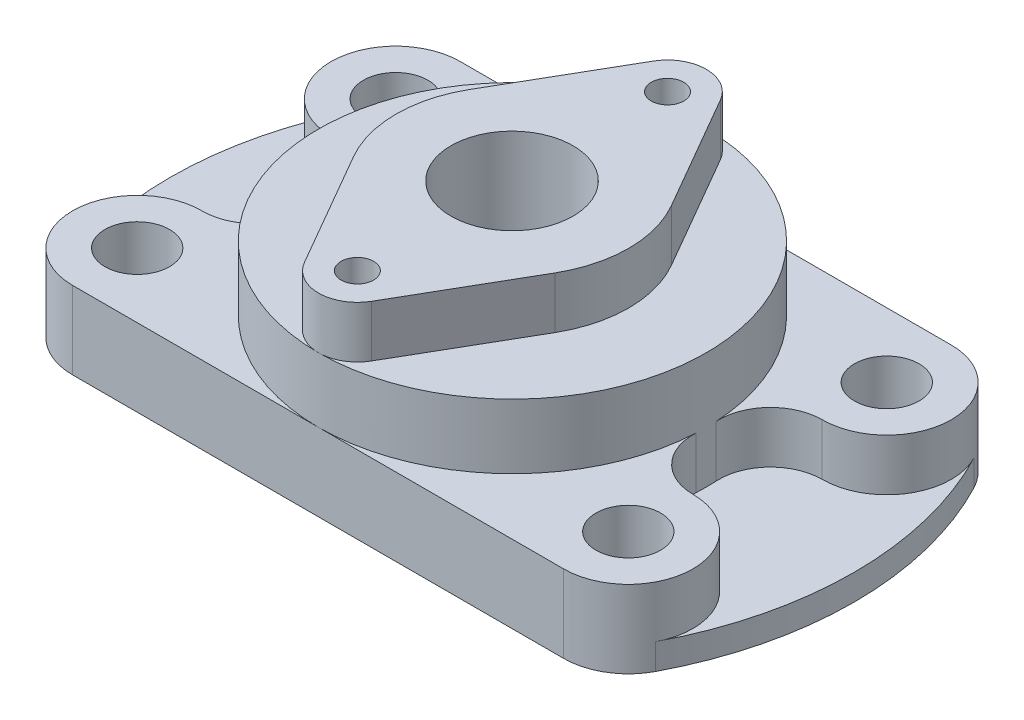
ISO-10303-21;
HEADER;
FILE_DESCRIPTION(('STEP AP214'),'2;1');
FILE_NAME('part.step','',(''),(''),'','','');
FILE_SCHEMA(('AUTOMOTIVE_DESIGN { 1 0 10303 214 1 1 1 1 }'));
ENDSEC;
DATA;
#1=APPLICATION_CONTEXT('core data for automotive mechanical design processes');
#2=APPLICATION_PROTOCOL_DEFINITION('international standard','automotive_design',2000,#1);
#3=PRODUCT_CONTEXT('',#1,'mechanical');
#4=PRODUCT('Part','Part','',(#3));
#5=PRODUCT_RELATED_PRODUCT_CATEGORY('part','',(#4));
#6=PRODUCT_DEFINITION_FORMATION('','',#4);
#7=PRODUCT_DEFINITION_CONTEXT('part definition',#1,'design');
#8=PRODUCT_DEFINITION('design','',#6,#7);
#9=PRODUCT_DEFINITION_SHAPE('','',#8);
#10=(LENGTH_UNIT() NAMED_UNIT(*) SI_UNIT(.MILLI.,.METRE.));
#11=(NAMED_UNIT(*) PLANE_ANGLE_UNIT() SI_UNIT($,.RADIAN.));
#12=(NAMED_UNIT(*) SI_UNIT($,.STERADIAN.) SOLID_ANGLE_UNIT());
#13=UNCERTAINTY_MEASURE_WITH_UNIT(LENGTH_MEASURE(1.E-05),#10,'distance_accuracy_value','');
#14=(GEOMETRIC_REPRESENTATION_CONTEXT(3) GLOBAL_UNCERTAINTY_ASSIGNED_CONTEXT((#13)) GLOBAL_UNIT_ASSIGNED_CONTEXT((#10,
#11,#12)) REPRESENTATION_CONTEXT('',''));
#15=CARTESIAN_POINT('',(0.,0.,0.));
#16=DIRECTION('',(0.,0.,1.));
#17=DIRECTION('',(1.,0.,0.));
#18=AXIS2_PLACEMENT_3D('',#15,#16,#17);
#19=CARTESIAN_POINT('',(0.0521752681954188,0.,0.));
#20=DIRECTION('',(0.,-1.,0.));
#21=DIRECTION('',(0.,0.,-1.));
#22=AXIS2_PLACEMENT_3D('',#19,#20,#21);
#23=PLANE('',#22);
#24=CARTESIAN_POINT('',(0.,0.,0.));
#25=DIRECTION('',(0.,1.,0.));
#26=DIRECTION('',(0.,0.,1.));
#27=AXIS2_PLACEMENT_3D('',#24,#25,#26);
#28=CIRCLE('',#27,7.49999999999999);
#29=CARTESIAN_POINT('',(0.,0.,7.49999999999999));
#30=VERTEX_POINT('',#29);
#31=EDGE_CURVE('E239',#30,#30,#28,.T.);
#32=ORIENTED_EDGE('',*,*,#31,.T.);
#33=EDGE_LOOP('',(#32));
#34=FACE_BOUND('',#33,.T.);
#35=CARTESIAN_POINT('',(30.1625,0.,15.875));
#36=DIRECTION('',(0.,-1.,0.));
#37=DIRECTION('',(0.,0.,1.));
#38=AXIS2_PLACEMENT_3D('',#35,#36,#37);
#39=CIRCLE('',#38,3.96875);
#40=CARTESIAN_POINT('',(30.1625,0.,19.84375));
#41=VERTEX_POINT('',#40);
#42=EDGE_CURVE('E242',#41,#41,#39,.T.);
#43=ORIENTED_EDGE('',*,*,#42,.F.);
#44=EDGE_LOOP('',(#43));
#45=FACE_BOUND('',#44,.T.);
#46=CARTESIAN_POINT('',(-30.1625,0.,15.875));
#47=DIRECTION('',(0.,1.,0.));
#48=DIRECTION('',(0.,0.,1.));
#49=AXIS2_PLACEMENT_3D('',#46,#47,#48);
#50=CIRCLE('',#49,3.96875);
#51=CARTESIAN_POINT('',(-30.1625,0.,19.84375));
#52=VERTEX_POINT('',#51);
#53=EDGE_CURVE('E253',#52,#52,#50,.T.);
#54=ORIENTED_EDGE('',*,*,#53,.T.);
#55=EDGE_LOOP('',(#54));
#56=FACE_BOUND('',#55,.T.);
#57=CARTESIAN_POINT('',(30.1625,0.,15.875));
#58=DIRECTION('',(0.,1.,0.));
#59=DIRECTION('',(0.,0.,-1.));
#60=AXIS2_PLACEMENT_3D('',#57,#58,#59);
#61=CIRCLE('',#60,7.9375);
#62=CARTESIAN_POINT('',(30.1625,0.,23.8125));
#63=VERTEX_POINT('',#62);
#64=CARTESIAN_POINT('',(37.1891686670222,0.,19.5668604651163));
#65=VERTEX_POINT('',#64);
#66=EDGE_CURVE('E398',#63,#65,#61,.T.);
#67=ORIENTED_EDGE('',*,*,#66,.F.);
#68=DIRECTION('',(1.,0.,0.));
#69=VECTOR('',#68,1.);
#70=CARTESIAN_POINT('',(-30.1625,0.,23.8125));
#71=LINE('',#70,#69);
#72=CARTESIAN_POINT('',(-30.1625,0.,23.8125));
#73=VERTEX_POINT('',#72);
#74=EDGE_CURVE('E396',#73,#63,#71,.T.);
#75=ORIENTED_EDGE('',*,*,#74,.F.);
#76=CARTESIAN_POINT('',(-30.1625,0.,15.875));
#77=DIRECTION('',(0.,1.,0.));
#78=DIRECTION('',(0.,0.,-1.));
#79=AXIS2_PLACEMENT_3D('',#76,#77,#78);
#80=CIRCLE('',#79,7.9375);
#81=CARTESIAN_POINT('',(-37.1891686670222,0.,19.5668604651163));
#82=VERTEX_POINT('',#81);
#83=EDGE_CURVE('E394',#82,#73,#80,.T.);
#84=ORIENTED_EDGE('',*,*,#83,.F.);
#85=CARTESIAN_POINT('',(0.0521752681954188,0.,0.));
#86=DIRECTION('',(0.,1.,0.));
#87=DIRECTION('',(0.,0.,-1.));
#88=AXIS2_PLACEMENT_3D('',#85,#86,#87);
#89=CIRCLE('',#88,42.06875);
#90=CARTESIAN_POINT('',(-37.1891686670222,0.,-19.5668604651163));
#91=VERTEX_POINT('',#90);
#92=EDGE_CURVE('E385',#91,#82,#89,.T.);
#93=ORIENTED_EDGE('',*,*,#92,.F.);
#94=CARTESIAN_POINT('',(-30.1625,0.,-15.875));
#95=DIRECTION('',(0.,1.,0.));
#96=DIRECTION('',(0.,0.,-1.));
#97=AXIS2_PLACEMENT_3D('',#94,#95,#96);
#98=CIRCLE('',#97,7.9375);
#99=CARTESIAN_POINT('',(-30.1625,0.,-23.8125));
#100=VERTEX_POINT('',#99);
#101=EDGE_CURVE('E389',#100,#91,#98,.T.);
#102=ORIENTED_EDGE('',*,*,#101,.F.);
#103=DIRECTION('',(-1.,0.,0.));
#104=VECTOR('',#103,1.);
#105=CARTESIAN_POINT('',(-30.1625,0.,-23.8125));
#106=LINE('',#105,#104);
#107=CARTESIAN_POINT('',(30.1625,0.,-23.8125));
#108=VERTEX_POINT('',#107);
#109=EDGE_CURVE('E404',#108,#100,#106,.T.);
#110=ORIENTED_EDGE('',*,*,#109,.F.);
#111=CARTESIAN_POINT('',(30.1625,0.,-15.875));
#112=DIRECTION('',(0.,1.,0.));
#113=DIRECTION('',(0.,0.,1.));
#114=AXIS2_PLACEMENT_3D('',#111,#112,#113);
#115=CIRCLE('',#114,7.9375);
#116=CARTESIAN_POINT('',(37.1891686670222,0.,-19.5668604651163));
#117=VERTEX_POINT('',#116);
#118=EDGE_CURVE('E402',#117,#108,#115,.T.);
#119=ORIENTED_EDGE('',*,*,#118,.F.);
#120=CARTESIAN_POINT('',(-0.0521752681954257,0.,0.));
#121=DIRECTION('',(0.,1.,0.));
#122=DIRECTION('',(0.,0.,-1.));
#123=AXIS2_PLACEMENT_3D('',#120,#121,#122);
#124=CIRCLE('',#123,42.06875);
#125=EDGE_CURVE('E400',#65,#117,#124,.T.);
#126=ORIENTED_EDGE('',*,*,#125,.F.);
#127=EDGE_LOOP('',(#67,#75,#84,#93,#102,#110,#119,#126));
#128=FACE_BOUND('',#127,.T.);
#129=CARTESIAN_POINT('',(-30.1625,0.,-15.875));
#130=DIRECTION('',(0.,-1.,0.));
#131=DIRECTION('',(0.,0.,-1.));
#132=AXIS2_PLACEMENT_3D('',#129,#130,#131);
#133=CIRCLE('',#132,3.96875);
#134=CARTESIAN_POINT('',(-30.1625,0.,-19.84375));
#135=VERTEX_POINT('',#134);
#136=EDGE_CURVE('E249',#135,#135,#133,.T.);
#137=ORIENTED_EDGE('',*,*,#136,.F.);
#138=EDGE_LOOP('',(#137));
#139=FACE_BOUND('',#138,.T.);
#140=CARTESIAN_POINT('',(30.1625,0.,-15.875));
#141=DIRECTION('',(0.,1.,0.));
#142=DIRECTION('',(0.,0.,-1.));
#143=AXIS2_PLACEMENT_3D('',#140,#141,#142);
#144=CIRCLE('',#143,3.96875);
#145=CARTESIAN_POINT('',(30.1625,0.,-19.84375));
#146=VERTEX_POINT('',#145);
#147=EDGE_CURVE('E245',#146,#146,#144,.T.);
#148=ORIENTED_EDGE('',*,*,#147,.T.);
#149=EDGE_LOOP('',(#148));
#150=FACE_BOUND('',#149,.T.);
#151=ADVANCED_FACE('F34',(#34,#45,#56,#128,#139,#150),#23,.T.);
#152=CARTESIAN_POINT('',(-30.1625,9.525,-15.875));
#153=DIRECTION('',(0.,1.,0.));
#154=DIRECTION('',(0.,0.,1.));
#155=AXIS2_PLACEMENT_3D('',#152,#153,#154);
#156=PLANE('',#155);
#157=DIRECTION('',(-1.,0.,0.));
#158=VECTOR('',#157,1.);
#159=CARTESIAN_POINT('',(-30.1625,9.525,-23.8125));
#160=LINE('',#159,#158);
#161=CARTESIAN_POINT('',(30.1625,9.525,-23.8125));
#162=VERTEX_POINT('',#161);
#163=CARTESIAN_POINT('',(0.0521752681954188,9.525,-23.8125));
#164=VERTEX_POINT('',#163);
#165=EDGE_CURVE('E328',#162,#164,#160,.T.);
#166=ORIENTED_EDGE('',*,*,#165,.T.);
#167=CARTESIAN_POINT('',(0.0521752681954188,9.525,0.));
#168=DIRECTION('',(0.,1.,0.));
#169=DIRECTION('',(0.,0.,1.));
#170=AXIS2_PLACEMENT_3D('',#167,#168,#169);
#171=CIRCLE('',#170,23.8125);
#172=CARTESIAN_POINT('',(23.8316709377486,9.525,-1.2532924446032));
#173=VERTEX_POINT('',#172);
#174=EDGE_CURVE('E562',#164,#173,#171,.F.);
#175=ORIENTED_EDGE('',*,*,#174,.T.);
#176=CARTESIAN_POINT('',(30.1728697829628,9.525,-1.58750376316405));
#177=DIRECTION('',(0.,-1.,0.));
#178=DIRECTION('',(0.,0.,1.));
#179=AXIS2_PLACEMENT_3D('',#176,#177,#178);
#180=CIRCLE('',#179,6.35);
#181=CARTESIAN_POINT('',(30.1682609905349,9.525,-7.93750209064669));
#182=VERTEX_POINT('',#181);
#183=EDGE_CURVE('E322',#173,#182,#180,.T.);
#184=ORIENTED_EDGE('',*,*,#183,.T.);
#185=CARTESIAN_POINT('',(30.1625,9.525,-15.875));
#186=DIRECTION('',(0.,1.,0.));
#187=DIRECTION('',(0.,0.,1.));
#188=AXIS2_PLACEMENT_3D('',#185,#186,#187);
#189=CIRCLE('',#188,7.9375);
#190=EDGE_CURVE('E324',#182,#162,#189,.T.);
#191=ORIENTED_EDGE('',*,*,#190,.T.);
#192=EDGE_LOOP('',(#166,#175,#184,#191));
#193=FACE_BOUND('',#192,.T.);
#194=CARTESIAN_POINT('',(30.1625,9.525,-15.875));
#195=DIRECTION('',(0.,1.,0.));
#196=DIRECTION('',(0.,0.,1.));
#197=AXIS2_PLACEMENT_3D('',#194,#195,#196);
#198=CIRCLE('',#197,3.96875);
#199=CARTESIAN_POINT('',(30.1625,9.525,-11.90625));
#200=VERTEX_POINT('',#199);
#201=EDGE_CURVE('E248',#200,#200,#198,.F.);
#202=ORIENTED_EDGE('',*,*,#201,.T.);
#203=EDGE_LOOP('',(#202));
#204=FACE_BOUND('',#203,.T.);
#205=ADVANCED_FACE('F459',(#193,#204),#156,.T.);
#206=DIRECTION('',(1.,0.,0.));
#207=VECTOR('',#206,1.);
#208=CARTESIAN_POINT('',(-30.1625,9.525,23.8125));
#209=LINE('',#208,#207);
#210=CARTESIAN_POINT('',(-30.1625,9.525,23.8125));
#211=VERTEX_POINT('',#210);
#212=CARTESIAN_POINT('',(0.0521752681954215,9.525,23.8125));
#213=VERTEX_POINT('',#212);
#214=EDGE_CURVE('E314',#211,#213,#209,.T.);
#215=ORIENTED_EDGE('',*,*,#214,.T.);
#216=CARTESIAN_POINT('',(-23.7273076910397,9.525,1.25353358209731));
#217=VERTEX_POINT('',#216);
#218=EDGE_CURVE('E60',#213,#217,#171,.F.);
#219=ORIENTED_EDGE('',*,*,#218,.T.);
#220=CARTESIAN_POINT('',(-30.0685031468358,9.525,1.58780920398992));
#221=DIRECTION('',(0.,-1.,0.));
#222=DIRECTION('',(0.,0.,1.));
#223=AXIS2_PLACEMENT_3D('',#220,#221,#222);
#224=CIRCLE('',#223,6.35);
#225=CARTESIAN_POINT('',(-30.1102795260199,9.525,7.9376717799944));
#226=VERTEX_POINT('',#225);
#227=EDGE_CURVE('E308',#217,#226,#224,.T.);
#228=ORIENTED_EDGE('',*,*,#227,.T.);
#229=CARTESIAN_POINT('',(-30.1625,9.525,15.875));
#230=DIRECTION('',(0.,1.,0.));
#231=DIRECTION('',(0.,0.,1.));
#232=AXIS2_PLACEMENT_3D('',#229,#230,#231);
#233=CIRCLE('',#232,7.9375);
#234=EDGE_CURVE('E310',#226,#211,#233,.T.);
#235=ORIENTED_EDGE('',*,*,#234,.T.);
#236=EDGE_LOOP('',(#215,#219,#228,#235));
#237=FACE_BOUND('',#236,.T.);
#238=CARTESIAN_POINT('',(-30.1625,9.525,15.875));
#239=DIRECTION('',(0.,1.,0.));
#240=DIRECTION('',(0.,0.,1.));
#241=AXIS2_PLACEMENT_3D('',#238,#239,#240);
#242=CIRCLE('',#241,3.96875);
#243=CARTESIAN_POINT('',(-30.1625,9.525,19.84375));
#244=VERTEX_POINT('',#243);
#245=EDGE_CURVE('E256',#244,#244,#242,.F.);
#246=ORIENTED_EDGE('',*,*,#245,.T.);
#247=EDGE_LOOP('',(#246));
#248=FACE_BOUND('',#247,.T.);
#249=ADVANCED_FACE('F475',(#237,#248),#156,.T.);
#250=CARTESIAN_POINT('',(0.0521752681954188,17.4625,0.));
#251=DIRECTION('',(0.,1.,0.));
#252=DIRECTION('',(0.,0.,1.));
#253=AXIS2_PLACEMENT_3D('',#250,#251,#252);
#254=PLANE('',#253);
#255=CARTESIAN_POINT('',(0.0521752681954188,17.4625,0.));
#256=DIRECTION('',(0.,1.,0.));
#257=DIRECTION('',(0.,0.,1.));
#258=AXIS2_PLACEMENT_3D('',#255,#256,#257);
#259=CIRCLE('',#258,23.8125);
#260=CARTESIAN_POINT('',(0.0521752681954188,17.4625,-23.8125));
#261=VERTEX_POINT('',#260);
#262=CARTESIAN_POINT('',(0.0521752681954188,17.4625,23.8125));
#263=VERTEX_POINT('',#262);
#264=EDGE_CURVE('E298',#261,#263,#259,.T.);
#265=ORIENTED_EDGE('',*,*,#264,.T.);
#266=CARTESIAN_POINT('',(0.0521752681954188,17.4625,19.05));
#267=DIRECTION('',(0.,1.,0.));
#268=DIRECTION('',(0.,0.,1.));
#269=AXIS2_PLACEMENT_3D('',#266,#267,#268);
#270=CIRCLE('',#269,4.7625);
#271=CARTESIAN_POINT('',(-4.07227071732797,17.4625,21.43125));
#272=VERTEX_POINT('',#271);
#273=EDGE_CURVE('E11',#263,#272,#270,.F.);
#274=ORIENTED_EDGE('',*,*,#273,.T.);
#275=DIRECTION('',(-0.5,0.,-0.866025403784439));
#276=VECTOR('',#275,1.);
#277=CARTESIAN_POINT('',(-12.3211626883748,17.4625,7.14375000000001));
#278=LINE('',#277,#276);
#279=CARTESIAN_POINT('',(-12.3211626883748,17.4625,7.14375000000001));
#280=VERTEX_POINT('',#279);
#281=EDGE_CURVE('E43',#272,#280,#278,.T.);
#282=ORIENTED_EDGE('',*,*,#281,.T.);
#283=CARTESIAN_POINT('',(0.0521752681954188,17.4625,0.));
#284=DIRECTION('',(0.,1.,0.));
#285=DIRECTION('',(0.,0.,1.));
#286=AXIS2_PLACEMENT_3D('',#283,#284,#285);
#287=CIRCLE('',#286,14.2875);
#288=CARTESIAN_POINT('',(-12.3211626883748,17.4625,-7.14374999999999));
#289=VERTEX_POINT('',#288);
#290=EDGE_CURVE('E439',#280,#289,#287,.F.);
#291=ORIENTED_EDGE('',*,*,#290,.T.);
#292=DIRECTION('',(0.5,0.,-0.866025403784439));
#293=VECTOR('',#292,1.);
#294=CARTESIAN_POINT('',(-12.3211626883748,17.4625,-7.14374999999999));
#295=LINE('',#294,#293);
#296=CARTESIAN_POINT('',(-4.07227071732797,17.4625,-21.43125));
#297=VERTEX_POINT('',#296);
#298=EDGE_CURVE('E433',#289,#297,#295,.T.);
#299=ORIENTED_EDGE('',*,*,#298,.T.);
#300=CARTESIAN_POINT('',(0.0521752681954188,17.4625,-19.05));
#301=DIRECTION('',(0.,1.,0.));
#302=DIRECTION('',(0.,0.,1.));
#303=AXIS2_PLACEMENT_3D('',#300,#301,#302);
#304=CIRCLE('',#303,4.7625);
#305=EDGE_CURVE('E436',#297,#261,#304,.F.);
#306=ORIENTED_EDGE('',*,*,#305,.T.);
#307=EDGE_LOOP('',(#265,#274,#282,#291,#299,#306));
#308=FACE_BOUND('',#307,.T.);
#309=ADVANCED_FACE('F614',(#308),#254,.T.);
#310=DIRECTION('',(-0.5,0.,0.866025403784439));
#311=VECTOR('',#310,1.);
#312=CARTESIAN_POINT('',(12.4255132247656,17.4625,7.14375));
#313=LINE('',#312,#311);
#314=CARTESIAN_POINT('',(12.4255132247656,17.4625,7.14375));
#315=VERTEX_POINT('',#314);
#316=CARTESIAN_POINT('',(4.17662125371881,17.4625,21.43125));
#317=VERTEX_POINT('',#316);
#318=EDGE_CURVE('E449',#315,#317,#313,.T.);
#319=ORIENTED_EDGE('',*,*,#318,.T.);
#320=EDGE_CURVE('E45',#317,#263,#270,.F.);
#321=ORIENTED_EDGE('',*,*,#320,.T.);
#322=EDGE_CURVE('E299',#263,#261,#259,.T.);
#323=ORIENTED_EDGE('',*,*,#322,.T.);
#324=CARTESIAN_POINT('',(4.17662125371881,17.4625,-21.43125));
#325=VERTEX_POINT('',#324);
#326=EDGE_CURVE('E440',#261,#325,#304,.F.);
#327=ORIENTED_EDGE('',*,*,#326,.T.);
#328=DIRECTION('',(0.5,0.,0.866025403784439));
#329=VECTOR('',#328,1.);
#330=CARTESIAN_POINT('',(12.4255132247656,17.4625,-7.14374999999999));
#331=LINE('',#330,#329);
#332=CARTESIAN_POINT('',(12.4255132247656,17.4625,-7.14374999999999));
#333=VERTEX_POINT('',#332);
#334=EDGE_CURVE('E443',#325,#333,#331,.T.);
#335=ORIENTED_EDGE('',*,*,#334,.T.);
#336=CARTESIAN_POINT('',(0.0521752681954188,17.4625,0.));
#337=DIRECTION('',(0.,1.,0.));
#338=DIRECTION('',(0.,0.,1.));
#339=AXIS2_PLACEMENT_3D('',#336,#337,#338);
#340=CIRCLE('',#339,14.2875);
#341=EDGE_CURVE('E446',#333,#315,#340,.F.);
#342=ORIENTED_EDGE('',*,*,#341,.T.);
#343=EDGE_LOOP('',(#319,#321,#323,#327,#335,#342));
#344=FACE_BOUND('',#343,.T.);
#345=ADVANCED_FACE('F619',(#344),#254,.T.);
#346=CARTESIAN_POINT('',(-30.1625,9.525,-15.875));
#347=DIRECTION('',(0.,1.,0.));
#348=DIRECTION('',(0.,0.,1.));
#349=AXIS2_PLACEMENT_3D('',#346,#347,#348);
#350=CIRCLE('',#349,3.96875);
#351=CARTESIAN_POINT('',(-30.1625,9.525,-11.90625));
#352=VERTEX_POINT('',#351);
#353=EDGE_CURVE('E252',#352,#352,#350,.T.);
#354=ORIENTED_EDGE('',*,*,#353,.F.);
#355=EDGE_LOOP('',(#354));
#356=FACE_BOUND('',#355,.T.);
#357=CARTESIAN_POINT('',(-30.0685031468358,9.525,-1.58780920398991));
#358=DIRECTION('',(0.,-1.,0.));
#359=DIRECTION('',(0.,0.,-1.));
#360=AXIS2_PLACEMENT_3D('',#357,#358,#359);
#361=CIRCLE('',#360,6.35);
#362=CARTESIAN_POINT('',(-30.1102795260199,9.525,-7.93767177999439));
#363=VERTEX_POINT('',#362);
#364=CARTESIAN_POINT('',(-23.7273076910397,9.525,-1.2535335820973));
#365=VERTEX_POINT('',#364);
#366=EDGE_CURVE('E305',#363,#365,#361,.T.);
#367=ORIENTED_EDGE('',*,*,#366,.T.);
#368=EDGE_CURVE('E432',#365,#164,#171,.F.);
#369=ORIENTED_EDGE('',*,*,#368,.T.);
#370=CARTESIAN_POINT('',(-30.1625,9.525,-23.8125));
#371=VERTEX_POINT('',#370);
#372=EDGE_CURVE('E327',#164,#371,#160,.T.);
#373=ORIENTED_EDGE('',*,*,#372,.T.);
#374=CARTESIAN_POINT('',(-30.1625,9.525,-15.875));
#375=DIRECTION('',(0.,1.,0.));
#376=DIRECTION('',(0.,0.,1.));
#377=AXIS2_PLACEMENT_3D('',#374,#375,#376);
#378=CIRCLE('',#377,7.9375);
#379=EDGE_CURVE('E302',#371,#363,#378,.T.);
#380=ORIENTED_EDGE('',*,*,#379,.T.);
#381=EDGE_LOOP('',(#367,#369,#373,#380));
#382=FACE_BOUND('',#381,.T.);
#383=ADVANCED_FACE('F478',(#356,#382),#156,.T.);
#384=CARTESIAN_POINT('',(30.1625,9.525,15.875));
#385=DIRECTION('',(0.,1.,0.));
#386=DIRECTION('',(0.,0.,1.));
#387=AXIS2_PLACEMENT_3D('',#384,#385,#386);
#388=CIRCLE('',#387,3.96875);
#389=CARTESIAN_POINT('',(30.1625,9.525,19.84375));
#390=VERTEX_POINT('',#389);
#391=EDGE_CURVE('E38',#390,#390,#388,.T.);
#392=ORIENTED_EDGE('',*,*,#391,.F.);
#393=EDGE_LOOP('',(#392));
#394=FACE_BOUND('',#393,.T.);
#395=CARTESIAN_POINT('',(30.1728697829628,9.525,1.58750376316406));
#396=DIRECTION('',(0.,-1.,0.));
#397=DIRECTION('',(0.,0.,-1.));
#398=AXIS2_PLACEMENT_3D('',#395,#396,#397);
#399=CIRCLE('',#398,6.35);
#400=CARTESIAN_POINT('',(30.1682609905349,9.525,7.9375020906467));
#401=VERTEX_POINT('',#400);
#402=CARTESIAN_POINT('',(23.8316709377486,9.525,1.25329244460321));
#403=VERTEX_POINT('',#402);
#404=EDGE_CURVE('E319',#401,#403,#399,.T.);
#405=ORIENTED_EDGE('',*,*,#404,.T.);
#406=EDGE_CURVE('E430',#403,#213,#171,.F.);
#407=ORIENTED_EDGE('',*,*,#406,.T.);
#408=CARTESIAN_POINT('',(30.1625,9.525,23.8125));
#409=VERTEX_POINT('',#408);
#410=EDGE_CURVE('E313',#213,#409,#209,.T.);
#411=ORIENTED_EDGE('',*,*,#410,.T.);
#412=CARTESIAN_POINT('',(30.1625,9.525,15.875));
#413=DIRECTION('',(0.,1.,0.));
#414=DIRECTION('',(0.,0.,1.));
#415=AXIS2_PLACEMENT_3D('',#412,#413,#414);
#416=CIRCLE('',#415,7.9375);
#417=EDGE_CURVE('E317',#409,#401,#416,.T.);
#418=ORIENTED_EDGE('',*,*,#417,.T.);
#419=EDGE_LOOP('',(#405,#407,#411,#418));
#420=FACE_BOUND('',#419,.T.);
#421=ADVANCED_FACE('F539',(#394,#420),#156,.T.);
#422=CARTESIAN_POINT('',(0.0521752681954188,3.175,0.));
#423=DIRECTION('',(0.,-1.,0.));
#424=DIRECTION('',(0.,0.,-1.));
#425=AXIS2_PLACEMENT_3D('',#422,#423,#424);
#426=PLANE('',#425);
#427=CARTESIAN_POINT('',(-30.1625,3.175,-15.875));
#428=DIRECTION('',(0.,-1.,0.));
#429=DIRECTION('',(0.,0.,-1.));
#430=AXIS2_PLACEMENT_3D('',#427,#428,#429);
#431=CIRCLE('',#430,7.9375);
#432=CARTESIAN_POINT('',(-37.1891686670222,3.175,-19.5668604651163));
#433=VERTEX_POINT('',#432);
#434=CARTESIAN_POINT('',(-30.1102795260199,3.175,-7.93767177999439));
#435=VERTEX_POINT('',#434);
#436=EDGE_CURVE('E382',#433,#435,#431,.F.);
#437=ORIENTED_EDGE('',*,*,#436,.F.);
#438=CARTESIAN_POINT('',(0.0521752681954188,3.175,0.));
#439=DIRECTION('',(0.,1.,0.));
#440=DIRECTION('',(0.,0.,-1.));
#441=AXIS2_PLACEMENT_3D('',#438,#439,#440);
#442=CIRCLE('',#441,42.06875);
#443=CARTESIAN_POINT('',(-37.1891686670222,3.175,19.5668604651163));
#444=VERTEX_POINT('',#443);
#445=EDGE_CURVE('E386',#433,#444,#442,.T.);
#446=ORIENTED_EDGE('',*,*,#445,.T.);
#447=CARTESIAN_POINT('',(-30.1625,3.175,15.875));
#448=DIRECTION('',(0.,-1.,0.));
#449=DIRECTION('',(0.,0.,-1.));
#450=AXIS2_PLACEMENT_3D('',#447,#448,#449);
#451=CIRCLE('',#450,7.9375);
#452=CARTESIAN_POINT('',(-30.1102795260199,3.175,7.9376717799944));
#453=VERTEX_POINT('',#452);
#454=EDGE_CURVE('E370',#453,#444,#451,.F.);
#455=ORIENTED_EDGE('',*,*,#454,.F.);
#456=CARTESIAN_POINT('',(-30.0685031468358,3.175,1.58780920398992));
#457=DIRECTION('',(0.,-1.,0.));
#458=DIRECTION('',(0.,0.,-1.));
#459=AXIS2_PLACEMENT_3D('',#456,#457,#458);
#460=CIRCLE('',#459,6.35);
#461=CARTESIAN_POINT('',(-23.7273076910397,3.175,1.25353358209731));
#462=VERTEX_POINT('',#461);
#463=EDGE_CURVE('E373',#462,#453,#460,.T.);
#464=ORIENTED_EDGE('',*,*,#463,.F.);
#465=CARTESIAN_POINT('',(0.0521752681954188,3.175,0.));
#466=DIRECTION('',(0.,-1.,0.));
#467=DIRECTION('',(0.,0.,-1.));
#468=AXIS2_PLACEMENT_3D('',#465,#466,#467);
#469=CIRCLE('',#468,23.8125);
#470=CARTESIAN_POINT('',(-23.7273076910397,3.175,-1.25353358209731));
#471=VERTEX_POINT('',#470);
#472=EDGE_CURVE('E376',#471,#462,#469,.F.);
#473=ORIENTED_EDGE('',*,*,#472,.F.);
#474=CARTESIAN_POINT('',(-30.0685031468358,3.175,-1.58780920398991));
#475=DIRECTION('',(0.,-1.,0.));
#476=DIRECTION('',(0.,0.,-1.));
#477=AXIS2_PLACEMENT_3D('',#474,#475,#476);
#478=CIRCLE('',#477,6.35);
#479=EDGE_CURVE('E379',#435,#471,#478,.T.);
#480=ORIENTED_EDGE('',*,*,#479,.F.);
#481=EDGE_LOOP('',(#437,#446,#455,#464,#473,#480));
#482=FACE_BOUND('',#481,.T.);
#483=ADVANCED_FACE('F482',(#482),#426,.F.);
#484=CARTESIAN_POINT('',(30.1625,3.175,15.875));
#485=DIRECTION('',(0.,-1.,0.));
#486=DIRECTION('',(0.,0.,-1.));
#487=AXIS2_PLACEMENT_3D('',#484,#485,#486);
#488=CIRCLE('',#487,7.9375);
#489=CARTESIAN_POINT('',(37.1891686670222,3.175,19.5668604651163));
#490=VERTEX_POINT('',#489);
#491=CARTESIAN_POINT('',(30.1682609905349,3.175,7.93750209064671));
#492=VERTEX_POINT('',#491);
#493=EDGE_CURVE('E367',#490,#492,#488,.F.);
#494=ORIENTED_EDGE('',*,*,#493,.F.);
#495=CARTESIAN_POINT('',(-0.0521752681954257,3.175,0.));
#496=DIRECTION('',(0.,1.,0.));
#497=DIRECTION('',(0.,0.,-1.));
#498=AXIS2_PLACEMENT_3D('',#495,#496,#497);
#499=CIRCLE('',#498,42.06875);
#500=CARTESIAN_POINT('',(37.1891686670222,3.175,-19.5668604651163));
#501=VERTEX_POINT('',#500);
#502=EDGE_CURVE('E388',#490,#501,#499,.T.);
#503=ORIENTED_EDGE('',*,*,#502,.T.);
#504=CARTESIAN_POINT('',(30.1625,3.175,-15.875));
#505=DIRECTION('',(0.,-1.,0.));
#506=DIRECTION('',(0.,0.,-1.));
#507=AXIS2_PLACEMENT_3D('',#504,#505,#506);
#508=CIRCLE('',#507,7.9375);
#509=CARTESIAN_POINT('',(30.1682609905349,3.175,-7.93750209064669));
#510=VERTEX_POINT('',#509);
#511=EDGE_CURVE('E355',#510,#501,#508,.F.);
#512=ORIENTED_EDGE('',*,*,#511,.F.);
#513=CARTESIAN_POINT('',(30.1728697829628,3.175,-1.58750376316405));
#514=DIRECTION('',(0.,-1.,0.));
#515=DIRECTION('',(0.,0.,-1.));
#516=AXIS2_PLACEMENT_3D('',#513,#514,#515);
#517=CIRCLE('',#516,6.35);
#518=CARTESIAN_POINT('',(23.8316709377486,3.175,-1.2532924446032));
#519=VERTEX_POINT('',#518);
#520=EDGE_CURVE('E358',#519,#510,#517,.T.);
#521=ORIENTED_EDGE('',*,*,#520,.F.);
#522=CARTESIAN_POINT('',(0.0521752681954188,3.175,0.));
#523=DIRECTION('',(0.,-1.,0.));
#524=DIRECTION('',(0.,0.,-1.));
#525=AXIS2_PLACEMENT_3D('',#522,#523,#524);
#526=CIRCLE('',#525,23.8125);
#527=CARTESIAN_POINT('',(23.8316709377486,3.175,1.25329244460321));
#528=VERTEX_POINT('',#527);
#529=EDGE_CURVE('E361',#528,#519,#526,.F.);
#530=ORIENTED_EDGE('',*,*,#529,.F.);
#531=CARTESIAN_POINT('',(30.1728697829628,3.175,1.58750376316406));
#532=DIRECTION('',(0.,-1.,0.));
#533=DIRECTION('',(0.,0.,-1.));
#534=AXIS2_PLACEMENT_3D('',#531,#532,#533);
#535=CIRCLE('',#534,6.35);
#536=EDGE_CURVE('E364',#492,#528,#535,.T.);
#537=ORIENTED_EDGE('',*,*,#536,.F.);
#538=EDGE_LOOP('',(#494,#503,#512,#521,#530,#537));
#539=FACE_BOUND('',#538,.T.);
#540=ADVANCED_FACE('F514',(#539),#426,.F.);
#541=CARTESIAN_POINT('',(0.0521752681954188,3.175,0.));
#542=DIRECTION('',(0.,-1.,0.));
#543=DIRECTION('',(0.,0.,-1.));
#544=AXIS2_PLACEMENT_3D('',#541,#542,#543);
#545=CYLINDRICAL_SURFACE('',#544,42.06875);
#546=ORIENTED_EDGE('',*,*,#92,.T.);
#547=DIRECTION('',(0.,-1.,0.));
#548=VECTOR('',#547,1.);
#549=CARTESIAN_POINT('',(-37.1891686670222,3.175,19.5668604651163));
#550=LINE('',#549,#548);
#551=EDGE_CURVE('E427',#444,#82,#550,.T.);
#552=ORIENTED_EDGE('',*,*,#551,.F.);
#553=ORIENTED_EDGE('',*,*,#445,.F.);
#554=DIRECTION('',(0.,-1.,0.));
#555=VECTOR('',#554,1.);
#556=CARTESIAN_POINT('',(-37.1891686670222,3.175,-19.5668604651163));
#557=LINE('',#556,#555);
#558=EDGE_CURVE('E391',#433,#91,#557,.T.);
#559=ORIENTED_EDGE('',*,*,#558,.T.);
#560=EDGE_LOOP('',(#546,#552,#553,#559));
#561=FACE_BOUND('',#560,.T.);
#562=ADVANCED_FACE('F36',(#561),#545,.T.);
#563=CARTESIAN_POINT('',(-30.1625,3.175,15.875));
#564=DIRECTION('',(0.,-1.,0.));
#565=DIRECTION('',(0.,0.,-1.));
#566=AXIS2_PLACEMENT_3D('',#563,#564,#565);
#567=CYLINDRICAL_SURFACE('',#566,7.9375);
#568=ORIENTED_EDGE('',*,*,#83,.T.);
#569=DIRECTION('',(0.,-1.,0.));
#570=VECTOR('',#569,1.);
#571=CARTESIAN_POINT('',(-30.1625,3.175,23.8125));
#572=LINE('',#571,#570);
#573=EDGE_CURVE('E424',#211,#73,#572,.T.);
#574=ORIENTED_EDGE('',*,*,#573,.F.);
#575=ORIENTED_EDGE('',*,*,#234,.F.);
#576=DIRECTION('',(0.,-1.,0.));
#577=VECTOR('',#576,1.);
#578=CARTESIAN_POINT('',(-30.1102795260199,9.525,7.9376717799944));
#579=LINE('',#578,#577);
#580=EDGE_CURVE('E343',#226,#453,#579,.T.);
#581=ORIENTED_EDGE('',*,*,#580,.T.);
#582=ORIENTED_EDGE('',*,*,#454,.T.);
#583=ORIENTED_EDGE('',*,*,#551,.T.);
#584=EDGE_LOOP('',(#568,#574,#575,#581,#582,#583));
#585=FACE_BOUND('',#584,.T.);
#586=ADVANCED_FACE('F507',(#585),#567,.T.);
#587=CARTESIAN_POINT('',(-30.1625,3.175,23.8125));
#588=DIRECTION('',(0.,0.,-1.));
#589=DIRECTION('',(-1.,0.,0.));
#590=AXIS2_PLACEMENT_3D('',#587,#588,#589);
#591=PLANE('',#590);
#592=ORIENTED_EDGE('',*,*,#74,.T.);
#593=DIRECTION('',(0.,-1.,0.));
#594=VECTOR('',#593,1.);
#595=CARTESIAN_POINT('',(30.1625,3.175,23.8125));
#596=LINE('',#595,#594);
#597=EDGE_CURVE('E421',#409,#63,#596,.T.);
#598=ORIENTED_EDGE('',*,*,#597,.F.);
#599=ORIENTED_EDGE('',*,*,#410,.F.);
#600=ORIENTED_EDGE('',*,*,#214,.F.);
#601=ORIENTED_EDGE('',*,*,#573,.T.);
#602=EDGE_LOOP('',(#592,#598,#599,#600,#601));
#603=FACE_BOUND('',#602,.T.);
#604=ADVANCED_FACE('F504',(#603),#591,.F.);
#605=CARTESIAN_POINT('',(30.1625,3.175,15.875));
#606=DIRECTION('',(0.,-1.,0.));
#607=DIRECTION('',(0.,0.,-1.));
#608=AXIS2_PLACEMENT_3D('',#605,#606,#607);
#609=CYLINDRICAL_SURFACE('',#608,7.9375);
#610=ORIENTED_EDGE('',*,*,#66,.T.);
#611=DIRECTION('',(0.,-1.,0.));
#612=VECTOR('',#611,1.);
#613=CARTESIAN_POINT('',(37.1891686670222,3.175,19.5668604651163));
#614=LINE('',#613,#612);
#615=EDGE_CURVE('E418',#490,#65,#614,.T.);
#616=ORIENTED_EDGE('',*,*,#615,.F.);
#617=ORIENTED_EDGE('',*,*,#493,.T.);
#618=DIRECTION('',(0.,-1.,0.));
#619=VECTOR('',#618,1.);
#620=CARTESIAN_POINT('',(30.1682609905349,9.525,7.9375020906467));
#621=LINE('',#620,#619);
#622=EDGE_CURVE('E340',#401,#492,#621,.T.);
#623=ORIENTED_EDGE('',*,*,#622,.F.);
#624=ORIENTED_EDGE('',*,*,#417,.F.);
#625=ORIENTED_EDGE('',*,*,#597,.T.);
#626=EDGE_LOOP('',(#610,#616,#617,#623,#624,#625));
#627=FACE_BOUND('',#626,.T.);
#628=ADVANCED_FACE('F500',(#627),#609,.T.);
#629=CARTESIAN_POINT('',(-0.0521752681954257,3.175,0.));
#630=DIRECTION('',(0.,-1.,0.));
#631=DIRECTION('',(0.,0.,-1.));
#632=AXIS2_PLACEMENT_3D('',#629,#630,#631);
#633=CYLINDRICAL_SURFACE('',#632,42.06875);
#634=ORIENTED_EDGE('',*,*,#125,.T.);
#635=DIRECTION('',(0.,-1.,0.));
#636=VECTOR('',#635,1.);
#637=CARTESIAN_POINT('',(37.1891686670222,3.175,-19.5668604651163));
#638=LINE('',#637,#636);
#639=EDGE_CURVE('E415',#501,#117,#638,.T.);
#640=ORIENTED_EDGE('',*,*,#639,.F.);
#641=ORIENTED_EDGE('',*,*,#502,.F.);
#642=ORIENTED_EDGE('',*,*,#615,.T.);
#643=EDGE_LOOP('',(#634,#640,#641,#642));
#644=FACE_BOUND('',#643,.T.);
#645=ADVANCED_FACE('F496',(#644),#633,.T.);
#646=CARTESIAN_POINT('',(30.1625,3.175,-15.875));
#647=DIRECTION('',(0.,-1.,0.));
#648=DIRECTION('',(0.,0.,-1.));
#649=AXIS2_PLACEMENT_3D('',#646,#647,#648);
#650=CYLINDRICAL_SURFACE('',#649,7.9375);
#651=ORIENTED_EDGE('',*,*,#118,.T.);
#652=DIRECTION('',(0.,-1.,0.));
#653=VECTOR('',#652,1.);
#654=CARTESIAN_POINT('',(30.1625,3.175,-23.8125));
#655=LINE('',#654,#653);
#656=EDGE_CURVE('E412',#162,#108,#655,.T.);
#657=ORIENTED_EDGE('',*,*,#656,.F.);
#658=ORIENTED_EDGE('',*,*,#190,.F.);
#659=DIRECTION('',(0.,-1.,0.));
#660=VECTOR('',#659,1.);
#661=CARTESIAN_POINT('',(30.1682609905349,9.525,-7.93750209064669));
#662=LINE('',#661,#660);
#663=EDGE_CURVE('E331',#182,#510,#662,.T.);
#664=ORIENTED_EDGE('',*,*,#663,.T.);
#665=ORIENTED_EDGE('',*,*,#511,.T.);
#666=ORIENTED_EDGE('',*,*,#639,.T.);
#667=EDGE_LOOP('',(#651,#657,#658,#664,#665,#666));
#668=FACE_BOUND('',#667,.T.);
#669=ADVANCED_FACE('F492',(#668),#650,.T.);
#670=CARTESIAN_POINT('',(-30.1625,3.175,-23.8125));
#671=DIRECTION('',(0.,0.,1.));
#672=DIRECTION('',(1.,0.,0.));
#673=AXIS2_PLACEMENT_3D('',#670,#671,#672);
#674=PLANE('',#673);
#675=ORIENTED_EDGE('',*,*,#109,.T.);
#676=DIRECTION('',(0.,-1.,0.));
#677=VECTOR('',#676,1.);
#678=CARTESIAN_POINT('',(-30.1625,3.175,-23.8125));
#679=LINE('',#678,#677);
#680=EDGE_CURVE('E409',#371,#100,#679,.T.);
#681=ORIENTED_EDGE('',*,*,#680,.F.);
#682=ORIENTED_EDGE('',*,*,#372,.F.);
#683=ORIENTED_EDGE('',*,*,#165,.F.);
#684=ORIENTED_EDGE('',*,*,#656,.T.);
#685=EDGE_LOOP('',(#675,#681,#682,#683,#684));
#686=FACE_BOUND('',#685,.T.);
#687=ADVANCED_FACE('F488',(#686),#674,.F.);
#688=CARTESIAN_POINT('',(-30.1625,3.175,-15.875));
#689=DIRECTION('',(0.,-1.,0.));
#690=DIRECTION('',(0.,0.,-1.));
#691=AXIS2_PLACEMENT_3D('',#688,#689,#690);
#692=CYLINDRICAL_SURFACE('',#691,7.9375);
#693=ORIENTED_EDGE('',*,*,#101,.T.);
#694=ORIENTED_EDGE('',*,*,#558,.F.);
#695=ORIENTED_EDGE('',*,*,#436,.T.);
#696=DIRECTION('',(0.,-1.,0.));
#697=VECTOR('',#696,1.);
#698=CARTESIAN_POINT('',(-30.1102795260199,9.525,-7.93767177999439));
#699=LINE('',#698,#697);
#700=EDGE_CURVE('E352',#363,#435,#699,.T.);
#701=ORIENTED_EDGE('',*,*,#700,.F.);
#702=ORIENTED_EDGE('',*,*,#379,.F.);
#703=ORIENTED_EDGE('',*,*,#680,.T.);
#704=EDGE_LOOP('',(#693,#694,#695,#701,#702,#703));
#705=FACE_BOUND('',#704,.T.);
#706=ADVANCED_FACE('F484',(#705),#692,.T.);
#707=CARTESIAN_POINT('',(-30.0685031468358,9.525,-1.58780920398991));
#708=DIRECTION('',(0.,-1.,0.));
#709=DIRECTION('',(0.,0.,-1.));
#710=AXIS2_PLACEMENT_3D('',#707,#708,#709);
#711=CYLINDRICAL_SURFACE('',#710,6.35);
#712=ORIENTED_EDGE('',*,*,#700,.T.);
#713=ORIENTED_EDGE('',*,*,#479,.T.);
#714=DIRECTION('',(0.,-1.,0.));
#715=VECTOR('',#714,1.);
#716=CARTESIAN_POINT('',(-23.7273076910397,9.525,-1.25353358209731));
#717=LINE('',#716,#715);
#718=EDGE_CURVE('E349',#365,#471,#717,.T.);
#719=ORIENTED_EDGE('',*,*,#718,.F.);
#720=ORIENTED_EDGE('',*,*,#366,.F.);
#721=EDGE_LOOP('',(#712,#713,#719,#720));
#722=FACE_BOUND('',#721,.T.);
#723=ADVANCED_FACE('F487',(#722),#711,.F.);
#724=CARTESIAN_POINT('',(0.0521752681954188,9.525,0.));
#725=DIRECTION('',(0.,-1.,0.));
#726=DIRECTION('',(0.,0.,-1.));
#727=AXIS2_PLACEMENT_3D('',#724,#725,#726);
#728=CYLINDRICAL_SURFACE('',#727,23.8125);
#729=ORIENTED_EDGE('',*,*,#218,.F.);
#730=ORIENTED_EDGE('',*,*,#406,.F.);
#731=DIRECTION('',(0.,-1.,0.));
#732=VECTOR('',#731,1.);
#733=CARTESIAN_POINT('',(23.8316709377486,9.525,1.25329244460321));
#734=LINE('',#733,#732);
#735=EDGE_CURVE('E337',#403,#528,#734,.T.);
#736=ORIENTED_EDGE('',*,*,#735,.T.);
#737=ORIENTED_EDGE('',*,*,#529,.T.);
#738=DIRECTION('',(0.,-1.,0.));
#739=VECTOR('',#738,1.);
#740=CARTESIAN_POINT('',(23.8316709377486,9.525,-1.2532924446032));
#741=LINE('',#740,#739);
#742=EDGE_CURVE('E334',#173,#519,#741,.T.);
#743=ORIENTED_EDGE('',*,*,#742,.F.);
#744=ORIENTED_EDGE('',*,*,#174,.F.);
#745=ORIENTED_EDGE('',*,*,#368,.F.);
#746=ORIENTED_EDGE('',*,*,#718,.T.);
#747=ORIENTED_EDGE('',*,*,#472,.T.);
#748=DIRECTION('',(0.,-1.,0.));
#749=VECTOR('',#748,1.);
#750=CARTESIAN_POINT('',(-23.7273076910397,9.525,1.25353358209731));
#751=LINE('',#750,#749);
#752=EDGE_CURVE('E346',#217,#462,#751,.T.);
#753=ORIENTED_EDGE('',*,*,#752,.F.);
#754=EDGE_LOOP('',(#729,#730,#736,#737,#743,#744,#745,#746,#747,#753));
#755=FACE_BOUND('',#754,.T.);
#756=ORIENTED_EDGE('',*,*,#322,.F.);
#757=ORIENTED_EDGE('',*,*,#264,.F.);
#758=EDGE_LOOP('',(#756,#757));
#759=FACE_BOUND('',#758,.T.);
#760=ADVANCED_FACE('F547',(#755,#759),#728,.T.);
#761=CARTESIAN_POINT('',(-30.0685031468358,9.525,1.58780920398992));
#762=DIRECTION('',(0.,-1.,0.));
#763=DIRECTION('',(0.,0.,-1.));
#764=AXIS2_PLACEMENT_3D('',#761,#762,#763);
#765=CYLINDRICAL_SURFACE('',#764,6.35);
#766=ORIENTED_EDGE('',*,*,#752,.T.);
#767=ORIENTED_EDGE('',*,*,#463,.T.);
#768=ORIENTED_EDGE('',*,*,#580,.F.);
#769=ORIENTED_EDGE('',*,*,#227,.F.);
#770=EDGE_LOOP('',(#766,#767,#768,#769));
#771=FACE_BOUND('',#770,.T.);
#772=ADVANCED_FACE('F545',(#771),#765,.F.);
#773=CARTESIAN_POINT('',(30.1728697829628,9.525,1.58750376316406));
#774=DIRECTION('',(0.,-1.,0.));
#775=DIRECTION('',(0.,0.,-1.));
#776=AXIS2_PLACEMENT_3D('',#773,#774,#775);
#777=CYLINDRICAL_SURFACE('',#776,6.35);
#778=ORIENTED_EDGE('',*,*,#622,.T.);
#779=ORIENTED_EDGE('',*,*,#536,.T.);
#780=ORIENTED_EDGE('',*,*,#735,.F.);
#781=ORIENTED_EDGE('',*,*,#404,.F.);
#782=EDGE_LOOP('',(#778,#779,#780,#781));
#783=FACE_BOUND('',#782,.T.);
#784=ADVANCED_FACE('F536',(#783),#777,.F.);
#785=CARTESIAN_POINT('',(30.1728697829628,9.525,-1.58750376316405));
#786=DIRECTION('',(0.,-1.,0.));
#787=DIRECTION('',(0.,0.,-1.));
#788=AXIS2_PLACEMENT_3D('',#785,#786,#787);
#789=CYLINDRICAL_SURFACE('',#788,6.35);
#790=ORIENTED_EDGE('',*,*,#742,.T.);
#791=ORIENTED_EDGE('',*,*,#520,.T.);
#792=ORIENTED_EDGE('',*,*,#663,.F.);
#793=ORIENTED_EDGE('',*,*,#183,.F.);
#794=EDGE_LOOP('',(#790,#791,#792,#793));
#795=FACE_BOUND('',#794,.T.);
#796=ADVANCED_FACE('F568',(#795),#789,.F.);
#797=CARTESIAN_POINT('',(0.0521752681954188,23.8125,0.));
#798=DIRECTION('',(0.,-1.,0.));
#799=DIRECTION('',(0.,0.,-1.));
#800=AXIS2_PLACEMENT_3D('',#797,#798,#799);
#801=CYLINDRICAL_SURFACE('',#800,14.2875);
#802=ORIENTED_EDGE('',*,*,#290,.F.);
#803=DIRECTION('',(0.,-1.,0.));
#804=VECTOR('',#803,1.);
#805=CARTESIAN_POINT('',(-12.3211626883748,23.8125,7.14375000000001));
#806=LINE('',#805,#804);
#807=CARTESIAN_POINT('',(-12.3211626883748,23.8125,7.14375000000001));
#808=VERTEX_POINT('',#807);
#809=EDGE_CURVE('E295',#808,#280,#806,.T.);
#810=ORIENTED_EDGE('',*,*,#809,.F.);
#811=CARTESIAN_POINT('',(0.0521752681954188,23.8125,0.));
#812=DIRECTION('',(0.,1.,0.));
#813=DIRECTION('',(0.,0.,-1.));
#814=AXIS2_PLACEMENT_3D('',#811,#812,#813);
#815=CIRCLE('',#814,14.2875);
#816=CARTESIAN_POINT('',(-12.3211626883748,23.8125,-7.14374999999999));
#817=VERTEX_POINT('',#816);
#818=EDGE_CURVE('E259',#817,#808,#815,.T.);
#819=ORIENTED_EDGE('',*,*,#818,.F.);
#820=DIRECTION('',(0.,-1.,0.));
#821=VECTOR('',#820,1.);
#822=CARTESIAN_POINT('',(-12.3211626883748,23.8125,-7.14374999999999));
#823=LINE('',#822,#821);
#824=EDGE_CURVE('E276',#817,#289,#823,.T.);
#825=ORIENTED_EDGE('',*,*,#824,.T.);
#826=EDGE_LOOP('',(#802,#810,#819,#825));
#827=FACE_BOUND('',#826,.T.);
#828=ADVANCED_FACE('F570',(#827),#801,.T.);
#829=CARTESIAN_POINT('',(-4.07227071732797,23.8125,21.43125));
#830=DIRECTION('',(0.866025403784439,0.,-0.5));
#831=DIRECTION('',(-0.5,0.,-0.866025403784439));
#832=AXIS2_PLACEMENT_3D('',#829,#830,#831);
#833=PLANE('',#832);
#834=ORIENTED_EDGE('',*,*,#281,.F.);
#835=DIRECTION('',(0.,-1.,0.));
#836=VECTOR('',#835,1.);
#837=CARTESIAN_POINT('',(-4.07227071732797,23.8125,21.43125));
#838=LINE('',#837,#836);
#839=CARTESIAN_POINT('',(-4.07227071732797,23.8125,21.43125));
#840=VERTEX_POINT('',#839);
#841=EDGE_CURVE('E292',#840,#272,#838,.T.);
#842=ORIENTED_EDGE('',*,*,#841,.F.);
#843=DIRECTION('',(0.5,0.,0.866025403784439));
#844=VECTOR('',#843,1.);
#845=CARTESIAN_POINT('',(-4.07227071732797,23.8125,21.43125));
#846=LINE('',#845,#844);
#847=EDGE_CURVE('E262',#808,#840,#846,.T.);
#848=ORIENTED_EDGE('',*,*,#847,.F.);
#849=ORIENTED_EDGE('',*,*,#809,.T.);
#850=EDGE_LOOP('',(#834,#842,#848,#849));
#851=FACE_BOUND('',#850,.T.);
#852=ADVANCED_FACE('F576',(#851),#833,.F.);
#853=CARTESIAN_POINT('',(0.0521752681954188,23.8125,19.05));
#854=DIRECTION('',(0.,-1.,0.));
#855=DIRECTION('',(0.,0.,-1.));
#856=AXIS2_PLACEMENT_3D('',#853,#854,#855);
#857=CYLINDRICAL_SURFACE('',#856,4.7625);
#858=ORIENTED_EDGE('',*,*,#320,.F.);
#859=DIRECTION('',(0.,-1.,0.));
#860=VECTOR('',#859,1.);
#861=CARTESIAN_POINT('',(4.17662125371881,23.8125,21.43125));
#862=LINE('',#861,#860);
#863=CARTESIAN_POINT('',(4.17662125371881,23.8125,21.43125));
#864=VERTEX_POINT('',#863);
#865=EDGE_CURVE('E289',#864,#317,#862,.T.);
#866=ORIENTED_EDGE('',*,*,#865,.F.);
#867=CARTESIAN_POINT('',(0.0521752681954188,23.8125,19.05));
#868=DIRECTION('',(0.,1.,0.));
#869=DIRECTION('',(0.,0.,-1.));
#870=AXIS2_PLACEMENT_3D('',#867,#868,#869);
#871=CIRCLE('',#870,4.7625);
#872=EDGE_CURVE('E264',#840,#864,#871,.T.);
#873=ORIENTED_EDGE('',*,*,#872,.F.);
#874=ORIENTED_EDGE('',*,*,#841,.T.);
#875=ORIENTED_EDGE('',*,*,#273,.F.);
#876=EDGE_LOOP('',(#858,#866,#873,#874,#875));
#877=FACE_BOUND('',#876,.T.);
#878=ADVANCED_FACE('F781',(#877),#857,.T.);
#879=CARTESIAN_POINT('',(12.4255132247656,23.8125,7.14375000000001));
#880=DIRECTION('',(-0.866025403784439,0.,-0.5));
#881=DIRECTION('',(-0.5,0.,0.866025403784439));
#882=AXIS2_PLACEMENT_3D('',#879,#880,#881);
#883=PLANE('',#882);
#884=ORIENTED_EDGE('',*,*,#318,.F.);
#885=DIRECTION('',(0.,-1.,0.));
#886=VECTOR('',#885,1.);
#887=CARTESIAN_POINT('',(12.4255132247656,23.8125,7.14375));
#888=LINE('',#887,#886);
#889=CARTESIAN_POINT('',(12.4255132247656,23.8125,7.14375));
#890=VERTEX_POINT('',#889);
#891=EDGE_CURVE('E286',#890,#315,#888,.T.);
#892=ORIENTED_EDGE('',*,*,#891,.F.);
#893=DIRECTION('',(0.5,0.,-0.866025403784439));
#894=VECTOR('',#893,1.);
#895=CARTESIAN_POINT('',(12.4255132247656,23.8125,7.14375000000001));
#896=LINE('',#895,#894);
#897=EDGE_CURVE('E266',#864,#890,#896,.T.);
#898=ORIENTED_EDGE('',*,*,#897,.F.);
#899=ORIENTED_EDGE('',*,*,#865,.T.);
#900=EDGE_LOOP('',(#884,#892,#898,#899));
#901=FACE_BOUND('',#900,.T.);
#902=ADVANCED_FACE('F771',(#901),#883,.F.);
#903=CARTESIAN_POINT('',(0.0521752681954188,23.8125,0.));
#904=DIRECTION('',(0.,-1.,0.));
#905=DIRECTION('',(0.,0.,-1.));
#906=AXIS2_PLACEMENT_3D('',#903,#904,#905);
#907=CYLINDRICAL_SURFACE('',#906,14.2875);
#908=ORIENTED_EDGE('',*,*,#341,.F.);
#909=DIRECTION('',(0.,-1.,0.));
#910=VECTOR('',#909,1.);
#911=CARTESIAN_POINT('',(12.4255132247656,23.8125,-7.14374999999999));
#912=LINE('',#911,#910);
#913=CARTESIAN_POINT('',(12.4255132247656,23.8125,-7.14374999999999));
#914=VERTEX_POINT('',#913);
#915=EDGE_CURVE('E283',#914,#333,#912,.T.);
#916=ORIENTED_EDGE('',*,*,#915,.F.);
#917=CARTESIAN_POINT('',(0.0521752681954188,23.8125,0.));
#918=DIRECTION('',(0.,1.,0.));
#919=DIRECTION('',(0.,0.,-1.));
#920=AXIS2_PLACEMENT_3D('',#917,#918,#919);
#921=CIRCLE('',#920,14.2875);
#922=EDGE_CURVE('E268',#890,#914,#921,.T.);
#923=ORIENTED_EDGE('',*,*,#922,.F.);
#924=ORIENTED_EDGE('',*,*,#891,.T.);
#925=EDGE_LOOP('',(#908,#916,#923,#924));
#926=FACE_BOUND('',#925,.T.);
#927=ADVANCED_FACE('F761',(#926),#907,.T.);
#928=CARTESIAN_POINT('',(4.17662125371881,23.8125,-21.43125));
#929=DIRECTION('',(-0.866025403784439,0.,0.5));
#930=DIRECTION('',(0.5,0.,0.866025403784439));
#931=AXIS2_PLACEMENT_3D('',#928,#929,#930);
#932=PLANE('',#931);
#933=ORIENTED_EDGE('',*,*,#334,.F.);
#934=DIRECTION('',(0.,-1.,0.));
#935=VECTOR('',#934,1.);
#936=CARTESIAN_POINT('',(4.17662125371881,23.8125,-21.43125));
#937=LINE('',#936,#935);
#938=CARTESIAN_POINT('',(4.17662125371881,23.8125,-21.43125));
#939=VERTEX_POINT('',#938);
#940=EDGE_CURVE('E280',#939,#325,#937,.T.);
#941=ORIENTED_EDGE('',*,*,#940,.F.);
#942=DIRECTION('',(-0.5,0.,-0.866025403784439));
#943=VECTOR('',#942,1.);
#944=CARTESIAN_POINT('',(4.17662125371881,23.8125,-21.43125));
#945=LINE('',#944,#943);
#946=EDGE_CURVE('E270',#914,#939,#945,.T.);
#947=ORIENTED_EDGE('',*,*,#946,.F.);
#948=ORIENTED_EDGE('',*,*,#915,.T.);
#949=EDGE_LOOP('',(#933,#941,#947,#948));
#950=FACE_BOUND('',#949,.T.);
#951=ADVANCED_FACE('F751',(#950),#932,.F.);
#952=CARTESIAN_POINT('',(0.0521752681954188,23.8125,-19.05));
#953=DIRECTION('',(0.,-1.,0.));
#954=DIRECTION('',(0.,0.,-1.));
#955=AXIS2_PLACEMENT_3D('',#952,#953,#954);
#956=CYLINDRICAL_SURFACE('',#955,4.7625);
#957=ORIENTED_EDGE('',*,*,#305,.F.);
#958=DIRECTION('',(0.,-1.,0.));
#959=VECTOR('',#958,1.);
#960=CARTESIAN_POINT('',(-4.07227071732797,23.8125,-21.43125));
#961=LINE('',#960,#959);
#962=CARTESIAN_POINT('',(-4.07227071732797,23.8125,-21.43125));
#963=VERTEX_POINT('',#962);
#964=EDGE_CURVE('E52',#963,#297,#961,.T.);
#965=ORIENTED_EDGE('',*,*,#964,.F.);
#966=CARTESIAN_POINT('',(0.0521752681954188,23.8125,-19.05));
#967=DIRECTION('',(0.,1.,0.));
#968=DIRECTION('',(0.,0.,-1.));
#969=AXIS2_PLACEMENT_3D('',#966,#967,#968);
#970=CIRCLE('',#969,4.7625);
#971=EDGE_CURVE('E272',#939,#963,#970,.T.);
#972=ORIENTED_EDGE('',*,*,#971,.F.);
#973=ORIENTED_EDGE('',*,*,#940,.T.);
#974=ORIENTED_EDGE('',*,*,#326,.F.);
#975=EDGE_LOOP('',(#957,#965,#972,#973,#974));
#976=FACE_BOUND('',#975,.T.);
#977=ADVANCED_FACE('F741',(#976),#956,.T.);
#978=CARTESIAN_POINT('',(-12.3211626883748,23.8125,-7.14374999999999));
#979=DIRECTION('',(0.866025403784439,0.,0.5));
#980=DIRECTION('',(0.5,0.,-0.866025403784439));
#981=AXIS2_PLACEMENT_3D('',#978,#979,#980);
#982=PLANE('',#981);
#983=ORIENTED_EDGE('',*,*,#298,.F.);
#984=ORIENTED_EDGE('',*,*,#824,.F.);
#985=DIRECTION('',(-0.5,0.,0.866025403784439));
#986=VECTOR('',#985,1.);
#987=CARTESIAN_POINT('',(-12.3211626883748,23.8125,-7.14374999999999));
#988=LINE('',#987,#986);
#989=EDGE_CURVE('E274',#963,#817,#988,.T.);
#990=ORIENTED_EDGE('',*,*,#989,.F.);
#991=ORIENTED_EDGE('',*,*,#964,.T.);
#992=EDGE_LOOP('',(#983,#984,#990,#991));
#993=FACE_BOUND('',#992,.T.);
#994=ADVANCED_FACE('F735',(#993),#982,.F.);
#995=CARTESIAN_POINT('',(0.0521752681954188,23.8125,0.));
#996=DIRECTION('',(0.,-1.,0.));
#997=DIRECTION('',(0.,0.,-1.));
#998=AXIS2_PLACEMENT_3D('',#995,#996,#997);
#999=PLANE('',#998);
#1000=CARTESIAN_POINT('',(0.0521752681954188,23.8125,-19.05));
#1001=DIRECTION('',(0.,1.,0.));
#1002=DIRECTION('',(0.,0.,1.));
#1003=AXIS2_PLACEMENT_3D('',#1000,#1001,#1002);
#1004=CIRCLE('',#1003,2.);
#1005=CARTESIAN_POINT('',(0.0521752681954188,23.8125,-17.05));
#1006=VERTEX_POINT('',#1005);
#1007=EDGE_CURVE('E226',#1006,#1006,#1004,.T.);
#1008=ORIENTED_EDGE('',*,*,#1007,.F.);
#1009=EDGE_LOOP('',(#1008));
#1010=FACE_BOUND('',#1009,.T.);
#1011=CARTESIAN_POINT('',(0.0521752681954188,23.8125,19.05));
#1012=DIRECTION('',(0.,1.,0.));
#1013=DIRECTION('',(0.,0.,1.));
#1014=AXIS2_PLACEMENT_3D('',#1011,#1012,#1013);
#1015=CIRCLE('',#1014,2.);
#1016=CARTESIAN_POINT('',(0.0521752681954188,23.8125,21.05));
#1017=VERTEX_POINT('',#1016);
#1018=EDGE_CURVE('E225',#1017,#1017,#1015,.T.);
#1019=ORIENTED_EDGE('',*,*,#1018,.F.);
#1020=EDGE_LOOP('',(#1019));
#1021=FACE_BOUND('',#1020,.T.);
#1022=CARTESIAN_POINT('',(0.,23.8125,0.));
#1023=DIRECTION('',(0.,1.,0.));
#1024=DIRECTION('',(0.,0.,1.));
#1025=AXIS2_PLACEMENT_3D('',#1022,#1023,#1024);
#1026=CIRCLE('',#1025,7.5);
#1027=CARTESIAN_POINT('',(0.,23.8125,7.5));
#1028=VERTEX_POINT('',#1027);
#1029=EDGE_CURVE('E236',#1028,#1028,#1026,.T.);
#1030=ORIENTED_EDGE('',*,*,#1029,.F.);
#1031=EDGE_LOOP('',(#1030));
#1032=FACE_BOUND('',#1031,.T.);
#1033=ORIENTED_EDGE('',*,*,#818,.T.);
#1034=ORIENTED_EDGE('',*,*,#847,.T.);
#1035=ORIENTED_EDGE('',*,*,#872,.T.);
#1036=ORIENTED_EDGE('',*,*,#897,.T.);
#1037=ORIENTED_EDGE('',*,*,#922,.T.);
#1038=ORIENTED_EDGE('',*,*,#946,.T.);
#1039=ORIENTED_EDGE('',*,*,#971,.T.);
#1040=ORIENTED_EDGE('',*,*,#989,.T.);
#1041=EDGE_LOOP('',(#1033,#1034,#1035,#1036,#1037,#1038,#1039,#1040));
#1042=FACE_BOUND('',#1041,.T.);
#1043=ADVANCED_FACE('F740',(#1010,#1021,#1032,#1042),#999,.F.);
#1044=CARTESIAN_POINT('',(-30.1625,23.8125,15.875));
#1045=DIRECTION('',(0.,-1.,0.));
#1046=DIRECTION('',(0.,0.,-1.));
#1047=AXIS2_PLACEMENT_3D('',#1044,#1045,#1046);
#1048=CYLINDRICAL_SURFACE('',#1047,3.96875);
#1049=ORIENTED_EDGE('',*,*,#245,.F.);
#1050=EDGE_LOOP('',(#1049));
#1051=FACE_BOUND('',#1050,.T.);
#1052=ORIENTED_EDGE('',*,*,#53,.F.);
#1053=EDGE_LOOP('',(#1052));
#1054=FACE_BOUND('',#1053,.T.);
#1055=ADVANCED_FACE('F706',(#1051,#1054),#1048,.F.);
#1056=CARTESIAN_POINT('',(-30.1625,23.8125,-15.875));
#1057=DIRECTION('',(0.,-1.,0.));
#1058=DIRECTION('',(0.,0.,-1.));
#1059=AXIS2_PLACEMENT_3D('',#1056,#1057,#1058);
#1060=CYLINDRICAL_SURFACE('',#1059,3.96875);
#1061=ORIENTED_EDGE('',*,*,#353,.T.);
#1062=EDGE_LOOP('',(#1061));
#1063=FACE_BOUND('',#1062,.T.);
#1064=ORIENTED_EDGE('',*,*,#136,.T.);
#1065=EDGE_LOOP('',(#1064));
#1066=FACE_BOUND('',#1065,.T.);
#1067=ADVANCED_FACE('F465',(#1063,#1066),#1060,.F.);
#1068=CARTESIAN_POINT('',(30.1625,23.8125,-15.875));
#1069=DIRECTION('',(0.,-1.,0.));
#1070=DIRECTION('',(0.,0.,-1.));
#1071=AXIS2_PLACEMENT_3D('',#1068,#1069,#1070);
#1072=CYLINDRICAL_SURFACE('',#1071,3.96875);
#1073=ORIENTED_EDGE('',*,*,#201,.F.);
#1074=EDGE_LOOP('',(#1073));
#1075=FACE_BOUND('',#1074,.T.);
#1076=ORIENTED_EDGE('',*,*,#147,.F.);
#1077=EDGE_LOOP('',(#1076));
#1078=FACE_BOUND('',#1077,.T.);
#1079=ADVANCED_FACE('F461',(#1075,#1078),#1072,.F.);
#1080=CARTESIAN_POINT('',(30.1625,23.8125,15.875));
#1081=DIRECTION('',(0.,-1.,0.));
#1082=DIRECTION('',(0.,0.,-1.));
#1083=AXIS2_PLACEMENT_3D('',#1080,#1081,#1082);
#1084=CYLINDRICAL_SURFACE('',#1083,3.96875);
#1085=ORIENTED_EDGE('',*,*,#391,.T.);
#1086=EDGE_LOOP('',(#1085));
#1087=FACE_BOUND('',#1086,.T.);
#1088=ORIENTED_EDGE('',*,*,#42,.T.);
#1089=EDGE_LOOP('',(#1088));
#1090=FACE_BOUND('',#1089,.T.);
#1091=ADVANCED_FACE('F464',(#1087,#1090),#1084,.F.);
#1092=CARTESIAN_POINT('',(0.,23.8125,0.));
#1093=DIRECTION('',(0.,1.,0.));
#1094=DIRECTION('',(0.,0.,1.));
#1095=AXIS2_PLACEMENT_3D('',#1092,#1093,#1094);
#1096=CYLINDRICAL_SURFACE('',#1095,7.5);
#1097=ORIENTED_EDGE('',*,*,#31,.F.);
#1098=EDGE_LOOP('',(#1097));
#1099=FACE_BOUND('',#1098,.T.);
#1100=ORIENTED_EDGE('',*,*,#1029,.T.);
#1101=EDGE_LOOP('',(#1100));
#1102=FACE_BOUND('',#1101,.T.);
#1103=ADVANCED_FACE('F815',(#1099,#1102),#1096,.F.);
#1104=CARTESIAN_POINT('',(0.0521752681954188,13.8125,19.05));
#1105=DIRECTION('',(0.,1.,0.));
#1106=DIRECTION('',(0.,0.,1.));
#1107=AXIS2_PLACEMENT_3D('',#1104,#1105,#1106);
#1108=CONICAL_SURFACE('',#1107,2.,1.02974425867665);
#1109=CARTESIAN_POINT('',(0.052175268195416,12.6107787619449,19.05));
#1110=VERTEX_POINT('',#1109);
#1111=VERTEX_LOOP('',#1110);
#1112=FACE_BOUND('',#1111,.T.);
#1113=CARTESIAN_POINT('',(0.0521752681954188,13.8125,19.05));
#1114=DIRECTION('',(0.,1.,0.));
#1115=DIRECTION('',(0.,0.,1.));
#1116=AXIS2_PLACEMENT_3D('',#1113,#1114,#1115);
#1117=CIRCLE('',#1116,2.);
#1118=CARTESIAN_POINT('',(0.0521752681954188,13.8125,21.05));
#1119=VERTEX_POINT('',#1118);
#1120=EDGE_CURVE('E229',#1119,#1119,#1117,.T.);
#1121=ORIENTED_EDGE('',*,*,#1120,.T.);
#1122=EDGE_LOOP('',(#1121));
#1123=FACE_BOUND('',#1122,.T.);
#1124=ADVANCED_FACE('F819',(#1112,#1123),#1108,.F.);
#1125=CARTESIAN_POINT('',(0.0521752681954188,23.8125,19.05));
#1126=DIRECTION('',(0.,1.,0.));
#1127=DIRECTION('',(0.,0.,1.));
#1128=AXIS2_PLACEMENT_3D('',#1125,#1126,#1127);
#1129=CYLINDRICAL_SURFACE('',#1128,2.);
#1130=ORIENTED_EDGE('',*,*,#1120,.F.);
#1131=EDGE_LOOP('',(#1130));
#1132=FACE_BOUND('',#1131,.T.);
#1133=ORIENTED_EDGE('',*,*,#1018,.T.);
#1134=EDGE_LOOP('',(#1133));
#1135=FACE_BOUND('',#1134,.T.);
#1136=ADVANCED_FACE('F219',(#1132,#1135),#1129,.F.);
#1137=CARTESIAN_POINT('',(0.0521752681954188,13.8125,-19.05));
#1138=DIRECTION('',(0.,1.,0.));
#1139=DIRECTION('',(0.,0.,1.));
#1140=AXIS2_PLACEMENT_3D('',#1137,#1138,#1139);
#1141=CONICAL_SURFACE('',#1140,2.,1.02974425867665);
#1142=CARTESIAN_POINT('',(0.052175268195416,12.6107787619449,-19.05));
#1143=VERTEX_POINT('',#1142);
#1144=VERTEX_LOOP('',#1143);
#1145=FACE_BOUND('',#1144,.T.);
#1146=CARTESIAN_POINT('',(0.0521752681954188,13.8125,-19.05));
#1147=DIRECTION('',(0.,1.,0.));
#1148=DIRECTION('',(0.,0.,1.));
#1149=AXIS2_PLACEMENT_3D('',#1146,#1147,#1148);
#1150=CIRCLE('',#1149,2.);
#1151=CARTESIAN_POINT('',(0.0521752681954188,13.8125,-17.05));
#1152=VERTEX_POINT('',#1151);
#1153=EDGE_CURVE('E223',#1152,#1152,#1150,.T.);
#1154=ORIENTED_EDGE('',*,*,#1153,.T.);
#1155=EDGE_LOOP('',(#1154));
#1156=FACE_BOUND('',#1155,.T.);
#1157=ADVANCED_FACE('F215',(#1145,#1156),#1141,.F.);
#1158=CARTESIAN_POINT('',(0.0521752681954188,23.8125,-19.05));
#1159=DIRECTION('',(0.,1.,0.));
#1160=DIRECTION('',(0.,0.,1.));
#1161=AXIS2_PLACEMENT_3D('',#1158,#1159,#1160);
#1162=CYLINDRICAL_SURFACE('',#1161,2.);
#1163=ORIENTED_EDGE('',*,*,#1153,.F.);
#1164=EDGE_LOOP('',(#1163));
#1165=FACE_BOUND('',#1164,.T.);
#1166=ORIENTED_EDGE('',*,*,#1007,.T.);
#1167=EDGE_LOOP('',(#1166));
#1168=FACE_BOUND('',#1167,.T.);
#1169=ADVANCED_FACE('F218',(#1165,#1168),#1162,.F.);
#1170=CLOSED_SHELL('',(#151,#205,#249,#309,#345,#383,#421,#483,#540,#562,#586,#604,#628,#645,
#669,#687,#706,#723,#760,#772,#784,#796,#828,#852,#878,#902,#927,#951,#977,#994,#1043,#1055,
#1067,#1079,#1091,#1103,#1124,#1136,#1157,#1169));
#1171=MANIFOLD_SOLID_BREP('B2',#1170);
#1172=ADVANCED_BREP_SHAPE_REPRESENTATION('',(#18,#1171),#14);
#1173=SHAPE_DEFINITION_REPRESENTATION(#9,#1172);
ENDSEC;
END-ISO-10303-21;
